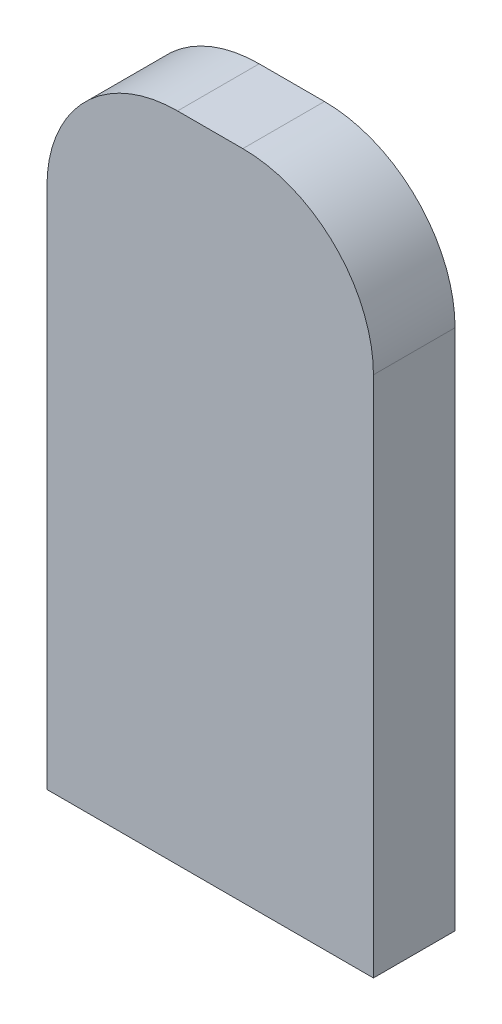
ISO-10303-21;
HEADER;
FILE_DESCRIPTION(('STEP AP214'),'2;1');
FILE_NAME('part.step','',(''),(''),'','','');
FILE_SCHEMA(('AUTOMOTIVE_DESIGN { 1 0 10303 214 1 1 1 1 }'));
ENDSEC;
DATA;
#1=APPLICATION_CONTEXT('core data for automotive mechanical design processes');
#2=APPLICATION_PROTOCOL_DEFINITION('international standard','automotive_design',2000,#1);
#3=PRODUCT_CONTEXT('',#1,'mechanical');
#4=PRODUCT('Part','Part','',(#3));
#5=PRODUCT_RELATED_PRODUCT_CATEGORY('part','',(#4));
#6=PRODUCT_DEFINITION_FORMATION('','',#4);
#7=PRODUCT_DEFINITION_CONTEXT('part definition',#1,'design');
#8=PRODUCT_DEFINITION('design','',#6,#7);
#9=PRODUCT_DEFINITION_SHAPE('','',#8);
#10=(LENGTH_UNIT() NAMED_UNIT(*) SI_UNIT(.MILLI.,.METRE.));
#11=(NAMED_UNIT(*) PLANE_ANGLE_UNIT() SI_UNIT($,.RADIAN.));
#12=(NAMED_UNIT(*) SI_UNIT($,.STERADIAN.) SOLID_ANGLE_UNIT());
#13=UNCERTAINTY_MEASURE_WITH_UNIT(LENGTH_MEASURE(1.E-05),#10,'distance_accuracy_value','');
#14=(GEOMETRIC_REPRESENTATION_CONTEXT(3) GLOBAL_UNCERTAINTY_ASSIGNED_CONTEXT((#13)) GLOBAL_UNIT_ASSIGNED_CONTEXT((#10,
#11,#12)) REPRESENTATION_CONTEXT('',''));
#15=CARTESIAN_POINT('',(0.,0.,0.));
#16=DIRECTION('',(0.,0.,1.));
#17=DIRECTION('',(1.,0.,0.));
#18=AXIS2_PLACEMENT_3D('',#15,#16,#17);
#19=CARTESIAN_POINT('',(0.,0.,5.));
#20=DIRECTION('',(-1.,0.,0.));
#21=DIRECTION('',(0.,-1.,0.));
#22=AXIS2_PLACEMENT_3D('',#19,#20,#21);
#23=PLANE('',#22);
#24=DIRECTION('',(0.,1.,0.));
#25=VECTOR('',#24,1.);
#26=CARTESIAN_POINT('',(0.,0.,5.));
#27=LINE('',#26,#25);
#28=CARTESIAN_POINT('',(0.,0.,5.));
#29=VERTEX_POINT('',#28);
#30=CARTESIAN_POINT('',(0.,32.,5.));
#31=VERTEX_POINT('',#30);
#32=EDGE_CURVE('E106',#29,#31,#27,.T.);
#33=ORIENTED_EDGE('',*,*,#32,.T.);
#34=DIRECTION('',(0.,0.,-1.));
#35=VECTOR('',#34,1.);
#36=CARTESIAN_POINT('',(0.,32.,5.));
#37=LINE('',#36,#35);
#38=CARTESIAN_POINT('',(0.,32.,0.));
#39=VERTEX_POINT('',#38);
#40=EDGE_CURVE('E113',#31,#39,#37,.T.);
#41=ORIENTED_EDGE('',*,*,#40,.T.);
#42=DIRECTION('',(0.,1.,0.));
#43=VECTOR('',#42,1.);
#44=CARTESIAN_POINT('',(0.,0.,0.));
#45=LINE('',#44,#43);
#46=CARTESIAN_POINT('',(0.,0.,0.));
#47=VERTEX_POINT('',#46);
#48=EDGE_CURVE('E109',#47,#39,#45,.T.);
#49=ORIENTED_EDGE('',*,*,#48,.F.);
#50=DIRECTION('',(0.,0.,-1.));
#51=VECTOR('',#50,1.);
#52=CARTESIAN_POINT('',(0.,0.,5.));
#53=LINE('',#52,#51);
#54=EDGE_CURVE('E102',#29,#47,#53,.T.);
#55=ORIENTED_EDGE('',*,*,#54,.F.);
#56=EDGE_LOOP('',(#33,#41,#49,#55));
#57=FACE_BOUND('',#56,.T.);
#58=ADVANCED_FACE('F47',(#57),#23,.T.);
#59=CARTESIAN_POINT('',(0.,0.,5.));
#60=DIRECTION('',(0.,1.,0.));
#61=DIRECTION('',(0.,0.,1.));
#62=AXIS2_PLACEMENT_3D('',#59,#60,#61);
#63=PLANE('',#62);
#64=DIRECTION('',(1.,0.,0.));
#65=VECTOR('',#64,1.);
#66=CARTESIAN_POINT('',(0.,0.,0.));
#67=LINE('',#66,#65);
#68=CARTESIAN_POINT('',(20.,0.,0.));
#69=VERTEX_POINT('',#68);
#70=EDGE_CURVE('E143',#47,#69,#67,.T.);
#71=ORIENTED_EDGE('',*,*,#70,.T.);
#72=DIRECTION('',(0.,0.,-1.));
#73=VECTOR('',#72,1.);
#74=CARTESIAN_POINT('',(20.,0.,5.));
#75=LINE('',#74,#73);
#76=CARTESIAN_POINT('',(20.,0.,5.));
#77=VERTEX_POINT('',#76);
#78=EDGE_CURVE('E114',#77,#69,#75,.T.);
#79=ORIENTED_EDGE('',*,*,#78,.F.);
#80=DIRECTION('',(1.,0.,0.));
#81=VECTOR('',#80,1.);
#82=CARTESIAN_POINT('',(0.,0.,5.));
#83=LINE('',#82,#81);
#84=EDGE_CURVE('E117',#29,#77,#83,.T.);
#85=ORIENTED_EDGE('',*,*,#84,.F.);
#86=ORIENTED_EDGE('',*,*,#54,.T.);
#87=EDGE_LOOP('',(#71,#79,#85,#86));
#88=FACE_BOUND('',#87,.T.);
#89=ADVANCED_FACE('F118',(#88),#63,.F.);
#90=CARTESIAN_POINT('',(20.,0.,5.));
#91=DIRECTION('',(-1.,0.,0.));
#92=DIRECTION('',(0.,-1.,0.));
#93=AXIS2_PLACEMENT_3D('',#90,#91,#92);
#94=PLANE('',#93);
#95=DIRECTION('',(0.,1.,0.));
#96=VECTOR('',#95,1.);
#97=CARTESIAN_POINT('',(20.,0.,0.));
#98=LINE('',#97,#96);
#99=CARTESIAN_POINT('',(20.,32.,0.));
#100=VERTEX_POINT('',#99);
#101=EDGE_CURVE('E130',#69,#100,#98,.T.);
#102=ORIENTED_EDGE('',*,*,#101,.T.);
#103=DIRECTION('',(0.,0.,-1.));
#104=VECTOR('',#103,1.);
#105=CARTESIAN_POINT('',(20.,32.,5.));
#106=LINE('',#105,#104);
#107=CARTESIAN_POINT('',(20.,32.,5.));
#108=VERTEX_POINT('',#107);
#109=EDGE_CURVE('E11',#100,#108,#106,.F.);
#110=ORIENTED_EDGE('',*,*,#109,.T.);
#111=DIRECTION('',(0.,1.,0.));
#112=VECTOR('',#111,1.);
#113=CARTESIAN_POINT('',(20.,0.,5.));
#114=LINE('',#113,#112);
#115=EDGE_CURVE('E121',#77,#108,#114,.T.);
#116=ORIENTED_EDGE('',*,*,#115,.F.);
#117=ORIENTED_EDGE('',*,*,#78,.T.);
#118=EDGE_LOOP('',(#102,#110,#116,#117));
#119=FACE_BOUND('',#118,.T.);
#120=ADVANCED_FACE('F178',(#119),#94,.F.);
#121=CARTESIAN_POINT('',(0.,40.,5.));
#122=DIRECTION('',(0.,1.,0.));
#123=DIRECTION('',(0.,0.,1.));
#124=AXIS2_PLACEMENT_3D('',#121,#122,#123);
#125=PLANE('',#124);
#126=DIRECTION('',(1.,0.,0.));
#127=VECTOR('',#126,1.);
#128=CARTESIAN_POINT('',(0.,40.,0.));
#129=LINE('',#128,#127);
#130=CARTESIAN_POINT('',(8.,40.,0.));
#131=VERTEX_POINT('',#130);
#132=CARTESIAN_POINT('',(12.,40.,0.));
#133=VERTEX_POINT('',#132);
#134=EDGE_CURVE('E126',#131,#133,#129,.T.);
#135=ORIENTED_EDGE('',*,*,#134,.F.);
#136=DIRECTION('',(0.,0.,-1.));
#137=VECTOR('',#136,1.);
#138=CARTESIAN_POINT('',(8.,40.,5.));
#139=LINE('',#138,#137);
#140=CARTESIAN_POINT('',(8.,40.,5.));
#141=VERTEX_POINT('',#140);
#142=EDGE_CURVE('E163',#131,#141,#139,.F.);
#143=ORIENTED_EDGE('',*,*,#142,.T.);
#144=DIRECTION('',(1.,0.,0.));
#145=VECTOR('',#144,1.);
#146=CARTESIAN_POINT('',(0.,40.,5.));
#147=LINE('',#146,#145);
#148=CARTESIAN_POINT('',(12.,40.,5.));
#149=VERTEX_POINT('',#148);
#150=EDGE_CURVE('E138',#141,#149,#147,.T.);
#151=ORIENTED_EDGE('',*,*,#150,.T.);
#152=DIRECTION('',(0.,0.,-1.));
#153=VECTOR('',#152,1.);
#154=CARTESIAN_POINT('',(12.,40.,0.));
#155=LINE('',#154,#153);
#156=EDGE_CURVE('E159',#149,#133,#155,.T.);
#157=ORIENTED_EDGE('',*,*,#156,.T.);
#158=EDGE_LOOP('',(#135,#143,#151,#157));
#159=FACE_BOUND('',#158,.T.);
#160=ADVANCED_FACE('F171',(#159),#125,.T.);
#161=CARTESIAN_POINT('',(0.,0.,5.));
#162=DIRECTION('',(0.,0.,1.));
#163=DIRECTION('',(1.,0.,0.));
#164=AXIS2_PLACEMENT_3D('',#161,#162,#163);
#165=PLANE('',#164);
#166=ORIENTED_EDGE('',*,*,#150,.F.);
#167=CARTESIAN_POINT('',(8.,32.,5.));
#168=DIRECTION('',(0.,0.,1.));
#169=DIRECTION('',(1.,0.,0.));
#170=AXIS2_PLACEMENT_3D('',#167,#168,#169);
#171=CIRCLE('',#170,8.);
#172=EDGE_CURVE('E56',#141,#31,#171,.T.);
#173=ORIENTED_EDGE('',*,*,#172,.T.);
#174=ORIENTED_EDGE('',*,*,#32,.F.);
#175=ORIENTED_EDGE('',*,*,#84,.T.);
#176=ORIENTED_EDGE('',*,*,#115,.T.);
#177=CARTESIAN_POINT('',(12.,32.,5.));
#178=DIRECTION('',(0.,0.,1.));
#179=DIRECTION('',(1.,0.,0.));
#180=AXIS2_PLACEMENT_3D('',#177,#178,#179);
#181=CIRCLE('',#180,8.);
#182=EDGE_CURVE('E68',#108,#149,#181,.T.);
#183=ORIENTED_EDGE('',*,*,#182,.T.);
#184=EDGE_LOOP('',(#166,#173,#174,#175,#176,#183));
#185=FACE_BOUND('',#184,.T.);
#186=ADVANCED_FACE('F123',(#185),#165,.T.);
#187=CARTESIAN_POINT('',(0.,0.,0.));
#188=DIRECTION('',(0.,0.,1.));
#189=DIRECTION('',(1.,0.,0.));
#190=AXIS2_PLACEMENT_3D('',#187,#188,#189);
#191=PLANE('',#190);
#192=CARTESIAN_POINT('',(10.,7.5,0.));
#193=DIRECTION('',(0.,0.,-1.));
#194=DIRECTION('',(-1.,0.,0.));
#195=AXIS2_PLACEMENT_3D('',#192,#193,#194);
#196=CIRCLE('',#195,5.1);
#197=CARTESIAN_POINT('',(4.9,7.5,0.));
#198=VERTEX_POINT('',#197);
#199=EDGE_CURVE('E230',#198,#198,#196,.T.);
#200=ORIENTED_EDGE('',*,*,#199,.F.);
#201=EDGE_LOOP('',(#200));
#202=FACE_BOUND('',#201,.T.);
#203=CARTESIAN_POINT('',(10.,20.,0.));
#204=DIRECTION('',(0.,0.,-1.));
#205=DIRECTION('',(-1.,0.,0.));
#206=AXIS2_PLACEMENT_3D('',#203,#204,#205);
#207=CIRCLE('',#206,5.1);
#208=CARTESIAN_POINT('',(4.9,20.,0.));
#209=VERTEX_POINT('',#208);
#210=EDGE_CURVE('E229',#209,#209,#207,.T.);
#211=ORIENTED_EDGE('',*,*,#210,.F.);
#212=EDGE_LOOP('',(#211));
#213=FACE_BOUND('',#212,.T.);
#214=CARTESIAN_POINT('',(10.,32.5,0.));
#215=DIRECTION('',(0.,0.,-1.));
#216=DIRECTION('',(-1.,0.,0.));
#217=AXIS2_PLACEMENT_3D('',#214,#215,#216);
#218=CIRCLE('',#217,5.1);
#219=CARTESIAN_POINT('',(4.9,32.5,0.));
#220=VERTEX_POINT('',#219);
#221=EDGE_CURVE('E133',#220,#220,#218,.T.);
#222=ORIENTED_EDGE('',*,*,#221,.F.);
#223=EDGE_LOOP('',(#222));
#224=FACE_BOUND('',#223,.T.);
#225=ORIENTED_EDGE('',*,*,#48,.T.);
#226=CARTESIAN_POINT('',(8.,32.,0.));
#227=DIRECTION('',(0.,0.,1.));
#228=DIRECTION('',(1.,0.,0.));
#229=AXIS2_PLACEMENT_3D('',#226,#227,#228);
#230=CIRCLE('',#229,8.);
#231=EDGE_CURVE('E156',#39,#131,#230,.F.);
#232=ORIENTED_EDGE('',*,*,#231,.T.);
#233=ORIENTED_EDGE('',*,*,#134,.T.);
#234=CARTESIAN_POINT('',(12.,32.,0.));
#235=DIRECTION('',(0.,0.,1.));
#236=DIRECTION('',(1.,0.,0.));
#237=AXIS2_PLACEMENT_3D('',#234,#235,#236);
#238=CIRCLE('',#237,8.);
#239=EDGE_CURVE('E153',#133,#100,#238,.F.);
#240=ORIENTED_EDGE('',*,*,#239,.T.);
#241=ORIENTED_EDGE('',*,*,#101,.F.);
#242=ORIENTED_EDGE('',*,*,#70,.F.);
#243=EDGE_LOOP('',(#225,#232,#233,#240,#241,#242));
#244=FACE_BOUND('',#243,.T.);
#245=ADVANCED_FACE('F176',(#202,#213,#224,#244),#191,.F.);
#246=CARTESIAN_POINT('',(10.,32.5,2.2));
#247=DIRECTION('',(0.,0.,-1.));
#248=DIRECTION('',(-1.,0.,0.));
#249=AXIS2_PLACEMENT_3D('',#246,#247,#248);
#250=CYLINDRICAL_SURFACE('',#249,5.1);
#251=CARTESIAN_POINT('',(10.,32.5,2.2));
#252=DIRECTION('',(0.,0.,-1.));
#253=DIRECTION('',(-1.,0.,0.));
#254=AXIS2_PLACEMENT_3D('',#251,#252,#253);
#255=CIRCLE('',#254,5.1);
#256=CARTESIAN_POINT('',(4.9,32.5,2.2));
#257=VERTEX_POINT('',#256);
#258=EDGE_CURVE('E144',#257,#257,#255,.T.);
#259=ORIENTED_EDGE('',*,*,#258,.F.);
#260=EDGE_LOOP('',(#259));
#261=FACE_BOUND('',#260,.T.);
#262=ORIENTED_EDGE('',*,*,#221,.T.);
#263=EDGE_LOOP('',(#262));
#264=FACE_BOUND('',#263,.T.);
#265=ADVANCED_FACE('F204',(#261,#264),#250,.F.);
#266=CARTESIAN_POINT('',(0.,0.,2.2));
#267=DIRECTION('',(0.,0.,-1.));
#268=DIRECTION('',(-1.,0.,0.));
#269=AXIS2_PLACEMENT_3D('',#266,#267,#268);
#270=PLANE('',#269);
#271=ORIENTED_EDGE('',*,*,#258,.T.);
#272=EDGE_LOOP('',(#271));
#273=FACE_BOUND('',#272,.T.);
#274=ADVANCED_FACE('F189',(#273),#270,.T.);
#275=CARTESIAN_POINT('',(8.,32.,5.));
#276=DIRECTION('',(0.,0.,-1.));
#277=DIRECTION('',(-1.,0.,0.));
#278=AXIS2_PLACEMENT_3D('',#275,#276,#277);
#279=CYLINDRICAL_SURFACE('',#278,8.);
#280=ORIENTED_EDGE('',*,*,#172,.F.);
#281=ORIENTED_EDGE('',*,*,#142,.F.);
#282=ORIENTED_EDGE('',*,*,#231,.F.);
#283=ORIENTED_EDGE('',*,*,#40,.F.);
#284=EDGE_LOOP('',(#280,#281,#282,#283));
#285=FACE_BOUND('',#284,.T.);
#286=ADVANCED_FACE('F174',(#285),#279,.T.);
#287=CARTESIAN_POINT('',(12.,32.,5.));
#288=DIRECTION('',(0.,0.,1.));
#289=DIRECTION('',(1.,0.,0.));
#290=AXIS2_PLACEMENT_3D('',#287,#288,#289);
#291=CYLINDRICAL_SURFACE('',#290,8.);
#292=ORIENTED_EDGE('',*,*,#182,.F.);
#293=ORIENTED_EDGE('',*,*,#109,.F.);
#294=ORIENTED_EDGE('',*,*,#239,.F.);
#295=ORIENTED_EDGE('',*,*,#156,.F.);
#296=EDGE_LOOP('',(#292,#293,#294,#295));
#297=FACE_BOUND('',#296,.T.);
#298=ADVANCED_FACE('F49',(#297),#291,.T.);
#299=CARTESIAN_POINT('',(10.,20.,2.25));
#300=DIRECTION('',(0.,0.,-1.));
#301=DIRECTION('',(-1.,0.,0.));
#302=AXIS2_PLACEMENT_3D('',#299,#300,#301);
#303=CYLINDRICAL_SURFACE('',#302,5.1);
#304=CARTESIAN_POINT('',(10.,20.,2.25));
#305=DIRECTION('',(0.,0.,-1.));
#306=DIRECTION('',(-1.,0.,0.));
#307=AXIS2_PLACEMENT_3D('',#304,#305,#306);
#308=CIRCLE('',#307,5.1);
#309=CARTESIAN_POINT('',(4.9,20.,2.25));
#310=VERTEX_POINT('',#309);
#311=EDGE_CURVE('E235',#310,#310,#308,.T.);
#312=ORIENTED_EDGE('',*,*,#311,.F.);
#313=EDGE_LOOP('',(#312));
#314=FACE_BOUND('',#313,.T.);
#315=ORIENTED_EDGE('',*,*,#210,.T.);
#316=EDGE_LOOP('',(#315));
#317=FACE_BOUND('',#316,.T.);
#318=ADVANCED_FACE('F181',(#314,#317),#303,.F.);
#319=CARTESIAN_POINT('',(0.,0.,2.25));
#320=DIRECTION('',(0.,0.,-1.));
#321=DIRECTION('',(-1.,0.,0.));
#322=AXIS2_PLACEMENT_3D('',#319,#320,#321);
#323=PLANE('',#322);
#324=ORIENTED_EDGE('',*,*,#311,.T.);
#325=EDGE_LOOP('',(#324));
#326=FACE_BOUND('',#325,.T.);
#327=ADVANCED_FACE('F186',(#326),#323,.T.);
#328=CARTESIAN_POINT('',(10.,7.5,2.3));
#329=DIRECTION('',(0.,0.,-1.));
#330=DIRECTION('',(-1.,0.,0.));
#331=AXIS2_PLACEMENT_3D('',#328,#329,#330);
#332=CYLINDRICAL_SURFACE('',#331,5.1);
#333=CARTESIAN_POINT('',(10.,7.5,2.3));
#334=DIRECTION('',(0.,0.,-1.));
#335=DIRECTION('',(-1.,0.,0.));
#336=AXIS2_PLACEMENT_3D('',#333,#334,#335);
#337=CIRCLE('',#336,5.1);
#338=CARTESIAN_POINT('',(4.9,7.5,2.3));
#339=VERTEX_POINT('',#338);
#340=EDGE_CURVE('E227',#339,#339,#337,.T.);
#341=ORIENTED_EDGE('',*,*,#340,.F.);
#342=EDGE_LOOP('',(#341));
#343=FACE_BOUND('',#342,.T.);
#344=ORIENTED_EDGE('',*,*,#199,.T.);
#345=EDGE_LOOP('',(#344));
#346=FACE_BOUND('',#345,.T.);
#347=ADVANCED_FACE('F215',(#343,#346),#332,.F.);
#348=CARTESIAN_POINT('',(0.,0.,2.3));
#349=DIRECTION('',(0.,0.,-1.));
#350=DIRECTION('',(-1.,0.,0.));
#351=AXIS2_PLACEMENT_3D('',#348,#349,#350);
#352=PLANE('',#351);
#353=ORIENTED_EDGE('',*,*,#340,.T.);
#354=EDGE_LOOP('',(#353));
#355=FACE_BOUND('',#354,.T.);
#356=ADVANCED_FACE('F219',(#355),#352,.T.);
#357=CLOSED_SHELL('',(#58,#89,#120,#160,#186,#245,#265,#274,#286,#298,#318,#327,#347,#356));
#358=MANIFOLD_SOLID_BREP('B2',#357);
#359=ADVANCED_BREP_SHAPE_REPRESENTATION('',(#18,#358),#14);
#360=SHAPE_DEFINITION_REPRESENTATION(#9,#359);
ENDSEC;
END-ISO-10303-21;
